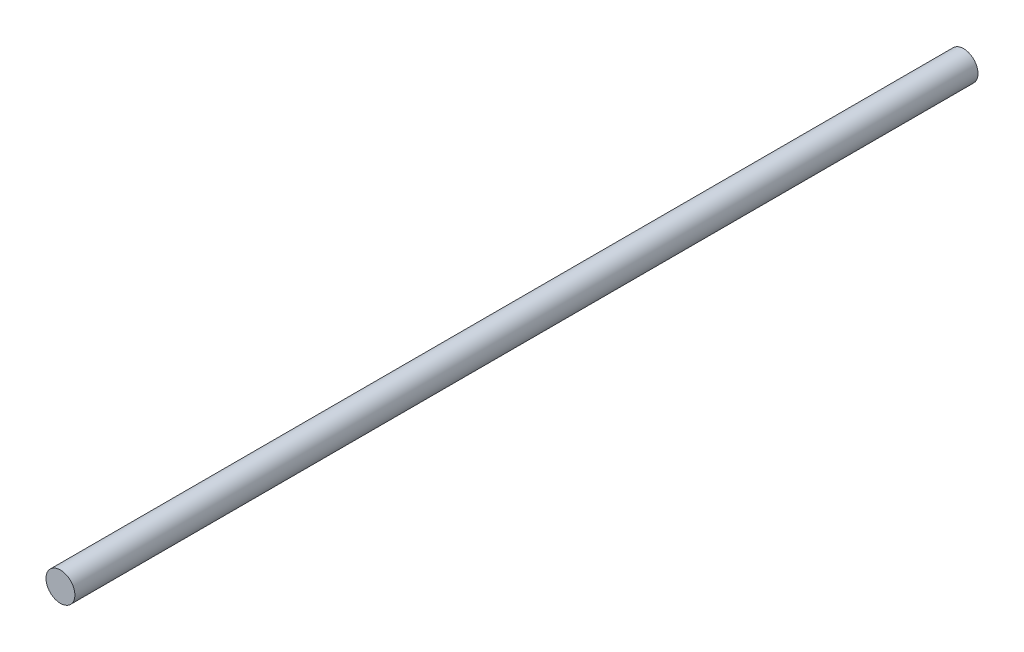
from build123d import *

# Parameters (mm, degrees)
ESQUISSE1_R      = 0.4
EXTRUSION1_DEPTH = 25


with BuildPart() as part:
    # Esquisse1 → Extrusion1 (new body)
    with BuildSketch(Plane.XY):
        Circle(ESQUISSE1_R)
    extrude(amount=EXTRUSION1_DEPTH)


solid = part.part
